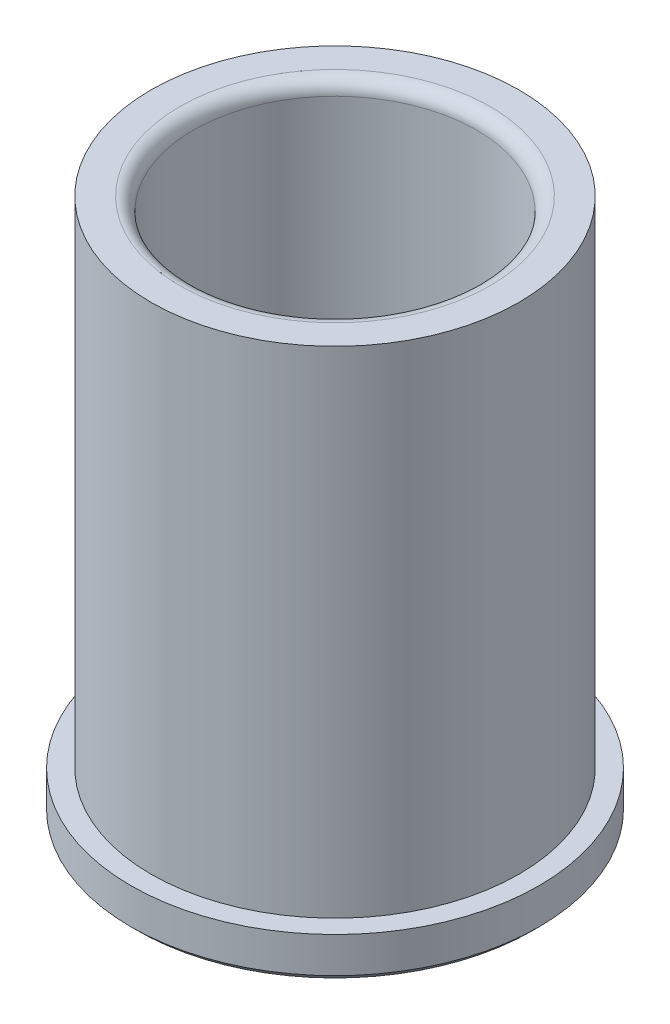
ISO-10303-21;
HEADER;
FILE_DESCRIPTION(('STEP AP214'),'2;1');
FILE_NAME('part.step','',(''),(''),'','','');
FILE_SCHEMA(('AUTOMOTIVE_DESIGN { 1 0 10303 214 1 1 1 1 }'));
ENDSEC;
DATA;
#1=APPLICATION_CONTEXT('core data for automotive mechanical design processes');
#2=APPLICATION_PROTOCOL_DEFINITION('international standard','automotive_design',2000,#1);
#3=PRODUCT_CONTEXT('',#1,'mechanical');
#4=PRODUCT('Part','Part','',(#3));
#5=PRODUCT_RELATED_PRODUCT_CATEGORY('part','',(#4));
#6=PRODUCT_DEFINITION_FORMATION('','',#4);
#7=PRODUCT_DEFINITION_CONTEXT('part definition',#1,'design');
#8=PRODUCT_DEFINITION('design','',#6,#7);
#9=PRODUCT_DEFINITION_SHAPE('','',#8);
#10=(LENGTH_UNIT() NAMED_UNIT(*) SI_UNIT(.MILLI.,.METRE.));
#11=(NAMED_UNIT(*) PLANE_ANGLE_UNIT() SI_UNIT($,.RADIAN.));
#12=(NAMED_UNIT(*) SI_UNIT($,.STERADIAN.) SOLID_ANGLE_UNIT());
#13=UNCERTAINTY_MEASURE_WITH_UNIT(LENGTH_MEASURE(1.E-05),#10,'distance_accuracy_value','');
#14=(GEOMETRIC_REPRESENTATION_CONTEXT(3) GLOBAL_UNCERTAINTY_ASSIGNED_CONTEXT((#13)) GLOBAL_UNIT_ASSIGNED_CONTEXT((#10,
#11,#12)) REPRESENTATION_CONTEXT('',''));
#15=CARTESIAN_POINT('',(0.,0.,0.));
#16=DIRECTION('',(0.,0.,1.));
#17=DIRECTION('',(1.,0.,0.));
#18=AXIS2_PLACEMENT_3D('',#15,#16,#17);
#19=CARTESIAN_POINT('',(3.49148336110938E-12,-1000.,0.));
#20=DIRECTION('',(0.,-1.,0.));
#21=DIRECTION('',(1.,0.,0.));
#22=AXIS2_PLACEMENT_3D('',#19,#20,#21);
#23=CYLINDRICAL_SURFACE('',#22,20.6438499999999);
#24=CARTESIAN_POINT('',(0.,4.7625,0.));
#25=DIRECTION('',(0.,-1.,0.));
#26=DIRECTION('',(1.,0.,0.));
#27=AXIS2_PLACEMENT_3D('',#24,#25,#26);
#28=CIRCLE('',#27,20.64385);
#29=CARTESIAN_POINT('',(20.6438499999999,4.76250000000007,0.));
#30=VERTEX_POINT('',#29);
#31=EDGE_CURVE('E60',#30,#30,#28,.T.);
#32=ORIENTED_EDGE('',*,*,#31,.F.);
#33=EDGE_LOOP('',(#32));
#34=FACE_BOUND('',#33,.T.);
#35=CARTESIAN_POINT('',(-2.10623733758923E-13,60.325,0.));
#36=DIRECTION('',(0.,-1.,0.));
#37=DIRECTION('',(1.,0.,0.));
#38=AXIS2_PLACEMENT_3D('',#35,#36,#37);
#39=CIRCLE('',#38,20.6438499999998);
#40=CARTESIAN_POINT('',(20.6438499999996,60.325,0.));
#41=VERTEX_POINT('',#40);
#42=EDGE_CURVE('E39',#41,#41,#39,.T.);
#43=ORIENTED_EDGE('',*,*,#42,.T.);
#44=EDGE_LOOP('',(#43));
#45=FACE_BOUND('',#44,.T.);
#46=ADVANCED_FACE('F28',(#34,#45),#23,.T.);
#47=CARTESIAN_POINT('',(-20.64385,60.325,0.));
#48=DIRECTION('',(0.,-1.,0.));
#49=DIRECTION('',(1.,0.,0.));
#50=AXIS2_PLACEMENT_3D('',#47,#48,#49);
#51=PLANE('',#50);
#52=CARTESIAN_POINT('',(-2.10623733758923E-13,60.3250000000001,0.));
#53=DIRECTION('',(0.,-1.,0.));
#54=DIRECTION('',(1.,0.,0.));
#55=AXIS2_PLACEMENT_3D('',#52,#53,#54);
#56=CIRCLE('',#55,17.4053499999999);
#57=CARTESIAN_POINT('',(17.4053499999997,60.3250000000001,0.));
#58=VERTEX_POINT('',#57);
#59=EDGE_CURVE('E35',#58,#58,#56,.T.);
#60=ORIENTED_EDGE('',*,*,#59,.T.);
#61=EDGE_LOOP('',(#60));
#62=FACE_BOUND('',#61,.T.);
#63=ORIENTED_EDGE('',*,*,#42,.F.);
#64=EDGE_LOOP('',(#63));
#65=FACE_BOUND('',#64,.T.);
#66=ADVANCED_FACE('F68',(#62,#65),#51,.F.);
#67=CARTESIAN_POINT('',(3.49148336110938E-12,-1000.,0.));
#68=DIRECTION('',(0.,-1.,0.));
#69=DIRECTION('',(1.,0.,0.));
#70=AXIS2_PLACEMENT_3D('',#67,#68,#69);
#71=CYLINDRICAL_SURFACE('',#70,15.8813499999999);
#72=CARTESIAN_POINT('',(-2.05302713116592E-13,58.8009999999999,0.));
#73=DIRECTION('',(0.,-1.,0.));
#74=DIRECTION('',(1.,0.,0.));
#75=AXIS2_PLACEMENT_3D('',#72,#73,#74);
#76=CIRCLE('',#75,15.8813499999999);
#77=CARTESIAN_POINT('',(15.8813499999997,58.8009999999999,0.));
#78=VERTEX_POINT('',#77);
#79=EDGE_CURVE('E10',#78,#78,#76,.F.);
#80=ORIENTED_EDGE('',*,*,#79,.T.);
#81=EDGE_LOOP('',(#80));
#82=FACE_BOUND('',#81,.T.);
#83=CARTESIAN_POINT('',(0.,0.761999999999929,0.));
#84=DIRECTION('',(0.,-1.,0.));
#85=DIRECTION('',(1.,0.,0.));
#86=AXIS2_PLACEMENT_3D('',#83,#84,#85);
#87=CIRCLE('',#86,15.88135);
#88=CARTESIAN_POINT('',(15.88135,0.761999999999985,0.));
#89=VERTEX_POINT('',#88);
#90=EDGE_CURVE('E43',#89,#89,#87,.T.);
#91=ORIENTED_EDGE('',*,*,#90,.T.);
#92=EDGE_LOOP('',(#91));
#93=FACE_BOUND('',#92,.T.);
#94=ADVANCED_FACE('F72',(#82,#93),#71,.F.);
#95=CARTESIAN_POINT('',(0.,0.,0.));
#96=DIRECTION('',(0.,-1.,0.));
#97=DIRECTION('',(1.,0.,0.));
#98=AXIS2_PLACEMENT_3D('',#95,#96,#97);
#99=CONICAL_SURFACE('',#98,16.64335,0.785398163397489);
#100=ORIENTED_EDGE('',*,*,#90,.F.);
#101=EDGE_LOOP('',(#100));
#102=FACE_BOUND('',#101,.T.);
#103=CARTESIAN_POINT('',(0.,0.,0.));
#104=DIRECTION('',(0.,-1.,0.));
#105=DIRECTION('',(1.,0.,0.));
#106=AXIS2_PLACEMENT_3D('',#103,#104,#105);
#107=CIRCLE('',#106,16.64335);
#108=CARTESIAN_POINT('',(16.64335,0.,0.));
#109=VERTEX_POINT('',#108);
#110=EDGE_CURVE('E48',#109,#109,#107,.T.);
#111=ORIENTED_EDGE('',*,*,#110,.T.);
#112=EDGE_LOOP('',(#111));
#113=FACE_BOUND('',#112,.T.);
#114=ADVANCED_FACE('F77',(#102,#113),#99,.F.);
#115=CARTESIAN_POINT('',(-16.64335,0.,0.));
#116=DIRECTION('',(0.,1.,0.));
#117=DIRECTION('',(-1.,0.,0.));
#118=AXIS2_PLACEMENT_3D('',#115,#116,#117);
#119=PLANE('',#118);
#120=ORIENTED_EDGE('',*,*,#110,.F.);
#121=EDGE_LOOP('',(#120));
#122=FACE_BOUND('',#121,.T.);
#123=CARTESIAN_POINT('',(0.,0.,0.));
#124=DIRECTION('',(0.,-1.,0.));
#125=DIRECTION('',(1.,0.,0.));
#126=AXIS2_PLACEMENT_3D('',#123,#124,#125);
#127=CIRCLE('',#126,22.1234);
#128=CARTESIAN_POINT('',(22.1234,0.,0.));
#129=VERTEX_POINT('',#128);
#130=EDGE_CURVE('E51',#129,#129,#127,.T.);
#131=ORIENTED_EDGE('',*,*,#130,.T.);
#132=EDGE_LOOP('',(#131));
#133=FACE_BOUND('',#132,.T.);
#134=ADVANCED_FACE('F82',(#122,#133),#119,.F.);
#135=CARTESIAN_POINT('',(0.,0.761999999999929,0.));
#136=DIRECTION('',(0.,1.,0.));
#137=DIRECTION('',(-1.,0.,0.));
#138=AXIS2_PLACEMENT_3D('',#135,#136,#137);
#139=CONICAL_SURFACE('',#138,22.8854,0.785398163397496);
#140=ORIENTED_EDGE('',*,*,#130,.F.);
#141=EDGE_LOOP('',(#140));
#142=FACE_BOUND('',#141,.T.);
#143=CARTESIAN_POINT('',(0.,0.761999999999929,0.));
#144=DIRECTION('',(0.,-1.,0.));
#145=DIRECTION('',(1.,0.,0.));
#146=AXIS2_PLACEMENT_3D('',#143,#144,#145);
#147=CIRCLE('',#146,22.8854);
#148=CARTESIAN_POINT('',(22.8854,0.762000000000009,0.));
#149=VERTEX_POINT('',#148);
#150=EDGE_CURVE('E54',#149,#149,#147,.T.);
#151=ORIENTED_EDGE('',*,*,#150,.T.);
#152=EDGE_LOOP('',(#151));
#153=FACE_BOUND('',#152,.T.);
#154=ADVANCED_FACE('F86',(#142,#153),#139,.T.);
#155=CARTESIAN_POINT('',(3.49148336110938E-12,-1000.,0.));
#156=DIRECTION('',(0.,-1.,0.));
#157=DIRECTION('',(1.,0.,0.));
#158=AXIS2_PLACEMENT_3D('',#155,#156,#157);
#159=CYLINDRICAL_SURFACE('',#158,22.8854);
#160=ORIENTED_EDGE('',*,*,#150,.F.);
#161=EDGE_LOOP('',(#160));
#162=FACE_BOUND('',#161,.T.);
#163=CARTESIAN_POINT('',(0.,4.7625,0.));
#164=DIRECTION('',(0.,-1.,0.));
#165=DIRECTION('',(1.,0.,0.));
#166=AXIS2_PLACEMENT_3D('',#163,#164,#165);
#167=CIRCLE('',#166,22.8854);
#168=CARTESIAN_POINT('',(22.8854,4.76250000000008,0.));
#169=VERTEX_POINT('',#168);
#170=EDGE_CURVE('E57',#169,#169,#167,.T.);
#171=ORIENTED_EDGE('',*,*,#170,.T.);
#172=EDGE_LOOP('',(#171));
#173=FACE_BOUND('',#172,.T.);
#174=ADVANCED_FACE('F90',(#162,#173),#159,.T.);
#175=CARTESIAN_POINT('',(-22.8854,4.76249999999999,0.));
#176=DIRECTION('',(0.,-1.,0.));
#177=DIRECTION('',(1.,0.,0.));
#178=AXIS2_PLACEMENT_3D('',#175,#176,#177);
#179=PLANE('',#178);
#180=ORIENTED_EDGE('',*,*,#170,.F.);
#181=EDGE_LOOP('',(#180));
#182=FACE_BOUND('',#181,.T.);
#183=ORIENTED_EDGE('',*,*,#31,.T.);
#184=EDGE_LOOP('',(#183));
#185=FACE_BOUND('',#184,.T.);
#186=ADVANCED_FACE('F64',(#182,#185),#179,.F.);
#187=CARTESIAN_POINT('',(-2.05302713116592E-13,58.8009999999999,0.));
#188=DIRECTION('',(0.,-1.,0.));
#189=DIRECTION('',(1.,0.,0.));
#190=AXIS2_PLACEMENT_3D('',#187,#188,#189);
#191=TOROIDAL_SURFACE('',#190,17.4053499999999,1.524);
#192=ORIENTED_EDGE('',*,*,#79,.F.);
#193=EDGE_LOOP('',(#192));
#194=FACE_BOUND('',#193,.T.);
#195=ORIENTED_EDGE('',*,*,#59,.F.);
#196=EDGE_LOOP('',(#195));
#197=FACE_BOUND('',#196,.T.);
#198=ADVANCED_FACE('F30',(#194,#197),#191,.T.);
#199=CLOSED_SHELL('',(#46,#66,#94,#114,#134,#154,#174,#186,#198));
#200=MANIFOLD_SOLID_BREP('B2',#199);
#201=ADVANCED_BREP_SHAPE_REPRESENTATION('',(#18,#200),#14);
#202=SHAPE_DEFINITION_REPRESENTATION(#9,#201);
ENDSEC;
END-ISO-10303-21;
